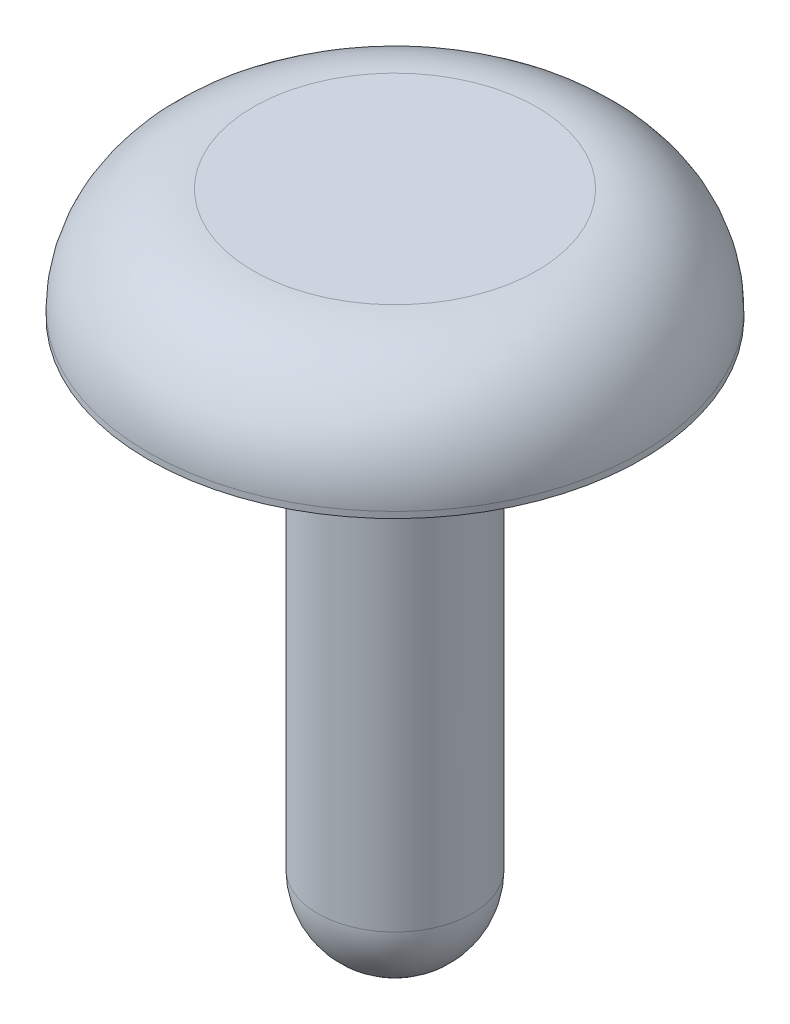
ISO-10303-21;
HEADER;
FILE_DESCRIPTION(('STEP AP214'),'2;1');
FILE_NAME('part.step','',(''),(''),'','','');
FILE_SCHEMA(('AUTOMOTIVE_DESIGN { 1 0 10303 214 1 1 1 1 }'));
ENDSEC;
DATA;
#1=APPLICATION_CONTEXT('core data for automotive mechanical design processes');
#2=APPLICATION_PROTOCOL_DEFINITION('international standard','automotive_design',2000,#1);
#3=PRODUCT_CONTEXT('',#1,'mechanical');
#4=PRODUCT('Part','Part','',(#3));
#5=PRODUCT_RELATED_PRODUCT_CATEGORY('part','',(#4));
#6=PRODUCT_DEFINITION_FORMATION('','',#4);
#7=PRODUCT_DEFINITION_CONTEXT('part definition',#1,'design');
#8=PRODUCT_DEFINITION('design','',#6,#7);
#9=PRODUCT_DEFINITION_SHAPE('','',#8);
#10=(LENGTH_UNIT() NAMED_UNIT(*) SI_UNIT(.MILLI.,.METRE.));
#11=(NAMED_UNIT(*) PLANE_ANGLE_UNIT() SI_UNIT($,.RADIAN.));
#12=(NAMED_UNIT(*) SI_UNIT($,.STERADIAN.) SOLID_ANGLE_UNIT());
#13=UNCERTAINTY_MEASURE_WITH_UNIT(LENGTH_MEASURE(1.E-05),#10,'distance_accuracy_value','');
#14=(GEOMETRIC_REPRESENTATION_CONTEXT(3) GLOBAL_UNCERTAINTY_ASSIGNED_CONTEXT((#13)) GLOBAL_UNIT_ASSIGNED_CONTEXT((#10,
#11,#12)) REPRESENTATION_CONTEXT('',''));
#15=CARTESIAN_POINT('',(0.,0.,0.));
#16=DIRECTION('',(0.,0.,1.));
#17=DIRECTION('',(1.,0.,0.));
#18=AXIS2_PLACEMENT_3D('',#15,#16,#17);
#19=CARTESIAN_POINT('',(0.,0.,0.));
#20=DIRECTION('',(0.,1.,0.));
#21=DIRECTION('',(0.,0.,1.));
#22=AXIS2_PLACEMENT_3D('',#19,#20,#21);
#23=PLANE('',#22);
#24=CARTESIAN_POINT('',(0.,0.,0.));
#25=DIRECTION('',(0.,1.,0.));
#26=DIRECTION('',(0.,0.,1.));
#27=AXIS2_PLACEMENT_3D('',#24,#25,#26);
#28=CIRCLE('',#27,2.29999999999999);
#29=CARTESIAN_POINT('',(0.,0.,2.29999999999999));
#30=VERTEX_POINT('',#29);
#31=EDGE_CURVE('E10',#30,#30,#28,.T.);
#32=ORIENTED_EDGE('',*,*,#31,.T.);
#33=EDGE_LOOP('',(#32));
#34=FACE_BOUND('',#33,.T.);
#35=ADVANCED_FACE('F32',(#34),#23,.T.);
#36=CARTESIAN_POINT('',(0.,-1.7,0.));
#37=DIRECTION('',(0.,1.,0.));
#38=DIRECTION('',(0.,0.,1.));
#39=AXIS2_PLACEMENT_3D('',#36,#37,#38);
#40=TOROIDAL_SURFACE('',#39,2.3,1.7);
#41=CARTESIAN_POINT('',(0.,-1.70000000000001,0.));
#42=DIRECTION('',(0.,1.,0.));
#43=DIRECTION('',(0.,0.,1.));
#44=AXIS2_PLACEMENT_3D('',#41,#42,#43);
#45=CIRCLE('',#44,4.);
#46=CARTESIAN_POINT('',(0.,-1.70000000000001,4.));
#47=VERTEX_POINT('',#46);
#48=EDGE_CURVE('E38',#47,#47,#45,.T.);
#49=ORIENTED_EDGE('',*,*,#48,.T.);
#50=EDGE_LOOP('',(#49));
#51=FACE_BOUND('',#50,.T.);
#52=ORIENTED_EDGE('',*,*,#31,.F.);
#53=EDGE_LOOP('',(#52));
#54=FACE_BOUND('',#53,.T.);
#55=ADVANCED_FACE('F73',(#51,#54),#40,.T.);
#56=CARTESIAN_POINT('',(0.,0.,0.));
#57=DIRECTION('',(0.,1.,0.));
#58=DIRECTION('',(0.,0.,1.));
#59=AXIS2_PLACEMENT_3D('',#56,#57,#58);
#60=CYLINDRICAL_SURFACE('',#59,4.);
#61=CARTESIAN_POINT('',(0.,-1.8,0.));
#62=DIRECTION('',(0.,1.,0.));
#63=DIRECTION('',(0.,0.,1.));
#64=AXIS2_PLACEMENT_3D('',#61,#62,#63);
#65=CIRCLE('',#64,4.);
#66=CARTESIAN_POINT('',(0.,-1.8,4.));
#67=VERTEX_POINT('',#66);
#68=EDGE_CURVE('E42',#67,#67,#65,.T.);
#69=ORIENTED_EDGE('',*,*,#68,.T.);
#70=EDGE_LOOP('',(#69));
#71=FACE_BOUND('',#70,.T.);
#72=ORIENTED_EDGE('',*,*,#48,.F.);
#73=EDGE_LOOP('',(#72));
#74=FACE_BOUND('',#73,.T.);
#75=ADVANCED_FACE('F77',(#71,#74),#60,.T.);
#76=CARTESIAN_POINT('',(-4.,-1.8,0.));
#77=DIRECTION('',(0.,-1.,0.));
#78=DIRECTION('',(0.,0.,-1.));
#79=AXIS2_PLACEMENT_3D('',#76,#77,#78);
#80=PLANE('',#79);
#81=CARTESIAN_POINT('',(0.,-1.8,0.));
#82=DIRECTION('',(0.,1.,0.));
#83=DIRECTION('',(0.,0.,1.));
#84=AXIS2_PLACEMENT_3D('',#81,#82,#83);
#85=CIRCLE('',#84,3.32735026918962);
#86=CARTESIAN_POINT('',(0.,-1.8,3.32735026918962));
#87=VERTEX_POINT('',#86);
#88=EDGE_CURVE('E46',#87,#87,#85,.T.);
#89=ORIENTED_EDGE('',*,*,#88,.T.);
#90=EDGE_LOOP('',(#89));
#91=FACE_BOUND('',#90,.T.);
#92=ORIENTED_EDGE('',*,*,#68,.F.);
#93=EDGE_LOOP('',(#92));
#94=FACE_BOUND('',#93,.T.);
#95=ADVANCED_FACE('F81',(#91,#94),#80,.T.);
#96=CARTESIAN_POINT('',(0.,-1.8,0.));
#97=DIRECTION('',(0.,-1.,0.));
#98=DIRECTION('',(0.,0.,-1.));
#99=AXIS2_PLACEMENT_3D('',#96,#97,#98);
#100=CONICAL_SURFACE('',#99,3.32735026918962,0.523598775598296);
#101=CARTESIAN_POINT('',(0.,-0.8,0.));
#102=DIRECTION('',(0.,1.,0.));
#103=DIRECTION('',(0.,0.,1.));
#104=AXIS2_PLACEMENT_3D('',#101,#102,#103);
#105=CIRCLE('',#104,2.75);
#106=CARTESIAN_POINT('',(0.,-0.8,2.75));
#107=VERTEX_POINT('',#106);
#108=EDGE_CURVE('E51',#107,#107,#105,.T.);
#109=ORIENTED_EDGE('',*,*,#108,.T.);
#110=EDGE_LOOP('',(#109));
#111=FACE_BOUND('',#110,.T.);
#112=ORIENTED_EDGE('',*,*,#88,.F.);
#113=EDGE_LOOP('',(#112));
#114=FACE_BOUND('',#113,.T.);
#115=ADVANCED_FACE('F88',(#111,#114),#100,.F.);
#116=CARTESIAN_POINT('',(-2.75,-0.8,0.));
#117=DIRECTION('',(0.,-1.,0.));
#118=DIRECTION('',(0.,0.,-1.));
#119=AXIS2_PLACEMENT_3D('',#116,#117,#118);
#120=PLANE('',#119);
#121=CARTESIAN_POINT('',(0.,-0.8,0.));
#122=DIRECTION('',(0.,1.,0.));
#123=DIRECTION('',(0.,0.,1.));
#124=AXIS2_PLACEMENT_3D('',#121,#122,#123);
#125=CIRCLE('',#124,1.25);
#126=CARTESIAN_POINT('',(0.,-0.8,1.25));
#127=VERTEX_POINT('',#126);
#128=EDGE_CURVE('E54',#127,#127,#125,.T.);
#129=ORIENTED_EDGE('',*,*,#128,.T.);
#130=EDGE_LOOP('',(#129));
#131=FACE_BOUND('',#130,.T.);
#132=ORIENTED_EDGE('',*,*,#108,.F.);
#133=EDGE_LOOP('',(#132));
#134=FACE_BOUND('',#133,.T.);
#135=ADVANCED_FACE('F70',(#131,#134),#120,.T.);
#136=CARTESIAN_POINT('',(0.,0.,0.));
#137=DIRECTION('',(0.,1.,0.));
#138=DIRECTION('',(0.,0.,1.));
#139=AXIS2_PLACEMENT_3D('',#136,#137,#138);
#140=CYLINDRICAL_SURFACE('',#139,1.25);
#141=CARTESIAN_POINT('',(0.,-9.55,0.));
#142=DIRECTION('',(0.,1.,0.));
#143=DIRECTION('',(0.,0.,1.));
#144=AXIS2_PLACEMENT_3D('',#141,#142,#143);
#145=CIRCLE('',#144,1.25);
#146=CARTESIAN_POINT('',(0.,-9.55,1.25));
#147=VERTEX_POINT('',#146);
#148=EDGE_CURVE('E57',#147,#147,#145,.T.);
#149=ORIENTED_EDGE('',*,*,#148,.T.);
#150=EDGE_LOOP('',(#149));
#151=FACE_BOUND('',#150,.T.);
#152=ORIENTED_EDGE('',*,*,#128,.F.);
#153=EDGE_LOOP('',(#152));
#154=FACE_BOUND('',#153,.T.);
#155=ADVANCED_FACE('F61',(#151,#154),#140,.T.);
#156=CARTESIAN_POINT('',(0.,-9.55,0.));
#157=DIRECTION('',(0.,1.,0.));
#158=DIRECTION('',(-1.,0.,0.));
#159=AXIS2_PLACEMENT_3D('',#156,#157,#158);
#160=SPHERICAL_SURFACE('',#159,1.25);
#161=ORIENTED_EDGE('',*,*,#148,.F.);
#162=EDGE_LOOP('',(#161));
#163=FACE_BOUND('',#162,.T.);
#164=ADVANCED_FACE('F64',(#163),#160,.T.);
#165=CLOSED_SHELL('',(#35,#55,#75,#95,#115,#135,#155,#164));
#166=MANIFOLD_SOLID_BREP('B2',#165);
#167=ADVANCED_BREP_SHAPE_REPRESENTATION('',(#18,#166),#14);
#168=SHAPE_DEFINITION_REPRESENTATION(#9,#167);
ENDSEC;
END-ISO-10303-21;
